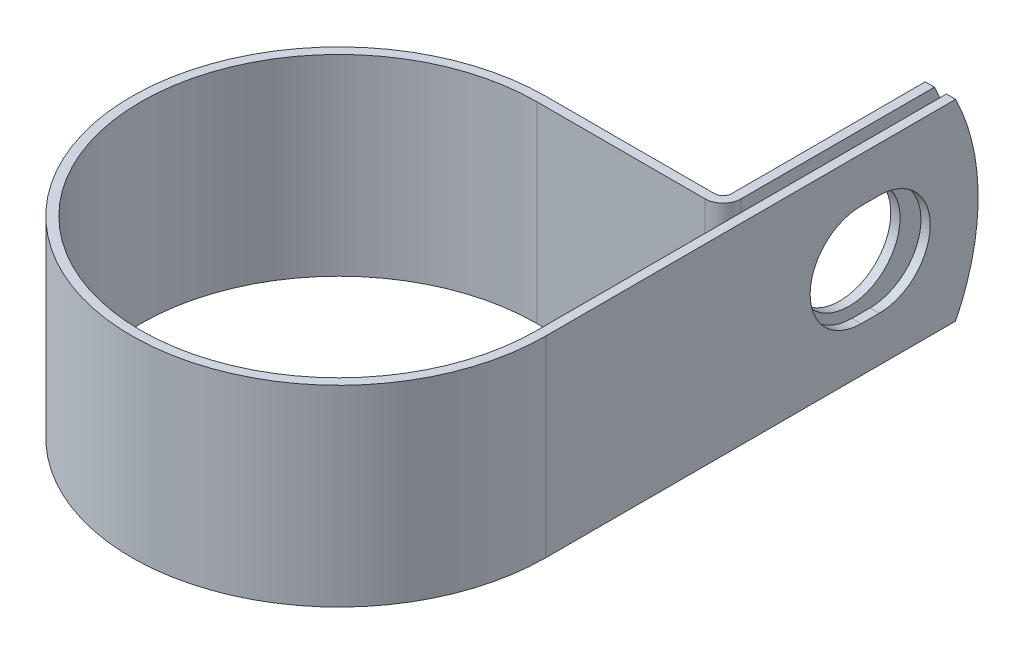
from build123d import *

# Parameters (mm, degrees)
EXTRUDE_THIN1_DEPTH = 12.7
SKETCH2_R           = 6.7437
CUT_EXTRUDE1_DEPTH  = 1.2192
CUT_EXTRUDE2_REACH  = 82.181
CUT_EXTRUDE3_DEPTH  = 78.492902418


with BuildPart() as part:
    # Sketch1 → Extrude-Thin1 (new, symmetric)
    with BuildSketch(Plane(origin=(0, 0, 0), x_dir=(1, 0, 0), z_dir=(0, 1, 0))):
        with BuildLine():
            Line((26.1874, 57.1246), (26.1874, 26.1874))
            Line((26.1874, 26.1874), (26.1874, 0))
            ThreePointArc((26.1874, 0), (-18.517288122, -18.517288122), (0, 26.1874))
            Line((0, 26.1874), (22.23516, 26.1874))
            ThreePointArc((22.23516, 26.1874), (23.916263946, 26.883736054), (24.6126, 28.56484))
            Line((24.6126, 28.56484), (24.6126, 57.1246))
            Line((24.6126, 57.1246), (23.3934, 57.1246))
            Line((23.3934, 57.1246), (23.3934, 28.56484))
            ThreePointArc((23.3934, 28.56484), (23.054159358, 27.745840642), (22.23516, 27.4066))
            Line((22.23516, 27.4066), (0, 27.4066))
            ThreePointArc((0, 27.4066), (-19.379392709, -19.379392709), (27.4066, 0))
            Line((27.4066, 0), (27.4066, 26.1874))
            Line((27.4066, 26.1874), (27.4066, 57.1246))
            Line((27.4066, 57.1246), (26.1874, 57.1246))
        make_face()
    extrude(amount=EXTRUDE_THIN1_DEPTH, both=True)

    # Sketch2 → Cut-Extrude1 (cut)
    with BuildSketch(Plane.ZY.offset(-23.3934)):
        with Locations((-42.8498, 0)):
            Circle(SKETCH2_R)
    extrude(amount=-CUT_EXTRUDE1_DEPTH, mode=Mode.SUBTRACT)

    # Sketch3 → Cut-Extrude2 (cut, up to next)
    with BuildSketch(Plane(origin=(27.4066, 0, 0), x_dir=(0, 0, -1), z_dir=(1, 0, 0)), mode=Mode.PRIVATE) as cut_extrude2_sk1:
        with BuildLine():
            Line((41.656, 6.7437), (44.0436, 6.7437))
            ThreePointArc((44.0436, 6.7437), (50.7873, 0), (44.0436, -6.7437))
            Line((44.0436, -6.7437), (41.656, -6.7437))
            ThreePointArc((41.656, -6.7437), (34.9123, 0), (41.656, 6.7437))
        make_face()
    cut_extrude2_tool1 = extrude(cut_extrude2_sk1.sketch, amount=-CUT_EXTRUDE2_REACH, mode=Mode.PRIVATE) & part.part
    add(cut_extrude2_tool1.solids().sort_by_distance((27.4066, 0, -42.8498))[0], mode=Mode.SUBTRACT)

    # Sketch4 → Cut-Extrude3 (cut, through all)
    with BuildSketch(Plane.ZY.offset(-23.3934)):
        with BuildLine():
            Line((-54.147268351, 12.7), (-57.1246, 12.7))
            Line((-57.1246, 12.7), (-57.1246, -1.91e-07))
            ThreePointArc((-57.1246, -1.91e-07), (-56.370311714, 6.522164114), (-54.147268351, 12.7))
        make_face()
        with BuildLine():
            ThreePointArc((-54.147268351, -12.7), (-56.37031167, -6.5221643), (-57.1246, -1.91e-07))
            Line((-57.1246, -1.91e-07), (-57.1246, -12.7))
            Line((-57.1246, -12.7), (-54.147268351, -12.7))
        make_face()
    extrude(amount=-CUT_EXTRUDE3_DEPTH, mode=Mode.SUBTRACT)


solid = part.part
